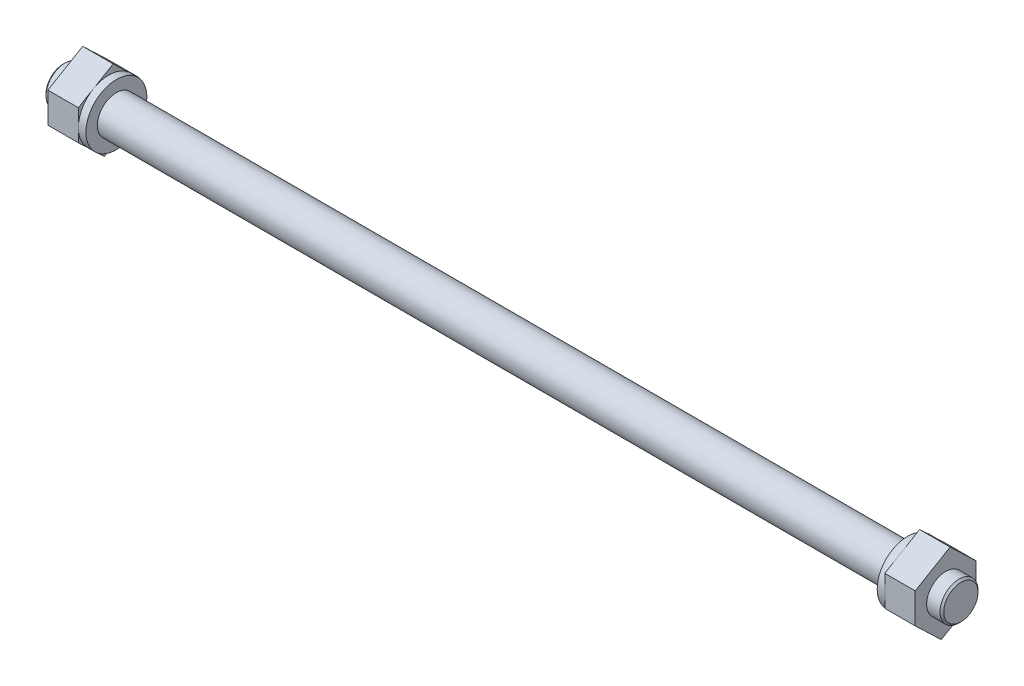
ISO-10303-21;
HEADER;
FILE_DESCRIPTION(('STEP AP214'),'2;1');
FILE_NAME('part.step','',(''),(''),'','','');
FILE_SCHEMA(('AUTOMOTIVE_DESIGN { 1 0 10303 214 1 1 1 1 }'));
ENDSEC;
DATA;
#1=APPLICATION_CONTEXT('core data for automotive mechanical design processes');
#2=APPLICATION_PROTOCOL_DEFINITION('international standard','automotive_design',2000,#1);
#3=PRODUCT_CONTEXT('',#1,'mechanical');
#4=PRODUCT('Part','Part','',(#3));
#5=PRODUCT_RELATED_PRODUCT_CATEGORY('part','',(#4));
#6=PRODUCT_DEFINITION_FORMATION('','',#4);
#7=PRODUCT_DEFINITION_CONTEXT('part definition',#1,'design');
#8=PRODUCT_DEFINITION('design','',#6,#7);
#9=PRODUCT_DEFINITION_SHAPE('','',#8);
#10=(LENGTH_UNIT() NAMED_UNIT(*) SI_UNIT(.MILLI.,.METRE.));
#11=(NAMED_UNIT(*) PLANE_ANGLE_UNIT() SI_UNIT($,.RADIAN.));
#12=(NAMED_UNIT(*) SI_UNIT($,.STERADIAN.) SOLID_ANGLE_UNIT());
#13=UNCERTAINTY_MEASURE_WITH_UNIT(LENGTH_MEASURE(1.E-05),#10,'distance_accuracy_value','');
#14=(GEOMETRIC_REPRESENTATION_CONTEXT(3) GLOBAL_UNCERTAINTY_ASSIGNED_CONTEXT((#13)) GLOBAL_UNIT_ASSIGNED_CONTEXT((#10,
#11,#12)) REPRESENTATION_CONTEXT('',''));
#15=CARTESIAN_POINT('',(0.,0.,0.));
#16=DIRECTION('',(0.,0.,1.));
#17=DIRECTION('',(1.,0.,0.));
#18=AXIS2_PLACEMENT_3D('',#15,#16,#17);
#19=CARTESIAN_POINT('',(-112.,-0.762935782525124,-6.58666148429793));
#20=DIRECTION('',(-1.,0.,0.));
#21=DIRECTION('',(0.,0.,1.));
#22=AXIS2_PLACEMENT_3D('',#19,#20,#21);
#23=PLANE('',#22);
#24=CARTESIAN_POINT('',(-112.,0.,0.));
#25=DIRECTION('',(-1.,0.,0.));
#26=DIRECTION('',(0.,0.,1.));
#27=AXIS2_PLACEMENT_3D('',#24,#25,#26);
#28=CIRCLE('',#27,4.00000000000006);
#29=CARTESIAN_POINT('',(-112.,-2.89136222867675,2.76405941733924));
#30=VERTEX_POINT('',#29);
#31=CARTESIAN_POINT('',(-112.,0.,4.00000000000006));
#32=VERTEX_POINT('',#31);
#33=EDGE_CURVE('E41',#30,#32,#28,.T.);
#34=ORIENTED_EDGE('',*,*,#33,.T.);
#35=DIRECTION('',(0.,-1.,0.));
#36=VECTOR('',#35,1.);
#37=CARTESIAN_POINT('',(-112.,2.28636451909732,4.));
#38=LINE('',#37,#36);
#39=CARTESIAN_POINT('',(-112.,-1.70983845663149,4.));
#40=VERTEX_POINT('',#39);
#41=EDGE_CURVE('E196',#32,#40,#38,.T.);
#42=ORIENTED_EDGE('',*,*,#41,.T.);
#43=DIRECTION('',(0.,-0.691014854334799,-0.722840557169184));
#44=VECTOR('',#43,1.);
#45=CARTESIAN_POINT('',(-112.,-1.70983845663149,4.));
#46=LINE('',#45,#44);
#47=EDGE_CURVE('E201',#40,#30,#46,.T.);
#48=ORIENTED_EDGE('',*,*,#47,.T.);
#49=EDGE_LOOP('',(#34,#42,#48));
#50=FACE_BOUND('',#49,.T.);
#51=ADVANCED_FACE('F26',(#50),#23,.F.);
#52=CARTESIAN_POINT('',(-112.,-3.44665142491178,-2.02992461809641));
#53=VERTEX_POINT('',#52);
#54=EDGE_CURVE('E45',#53,#30,#28,.T.);
#55=ORIENTED_EDGE('',*,*,#54,.T.);
#56=CARTESIAN_POINT('',(-112.,-4.98205774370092,0.577073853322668));
#57=VERTEX_POINT('',#56);
#58=EDGE_CURVE('E200',#30,#57,#46,.T.);
#59=ORIENTED_EDGE('',*,*,#58,.T.);
#60=DIRECTION('',(0.,0.507481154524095,-0.86166285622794));
#61=VECTOR('',#60,1.);
#62=CARTESIAN_POINT('',(-112.,-4.98205774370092,0.577073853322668));
#63=LINE('',#62,#61);
#64=EDGE_CURVE('E205',#57,#53,#63,.T.);
#65=ORIENTED_EDGE('',*,*,#64,.T.);
#66=EDGE_LOOP('',(#55,#59,#65));
#67=FACE_BOUND('',#66,.T.);
#68=ADVANCED_FACE('F331',(#67),#23,.F.);
#69=CARTESIAN_POINT('',(-112.,0.,-4.00000000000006));
#70=VERTEX_POINT('',#69);
#71=EDGE_CURVE('E598',#70,#53,#28,.T.);
#72=ORIENTED_EDGE('',*,*,#71,.T.);
#73=CARTESIAN_POINT('',(-112.,-2.28636451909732,-4.));
#74=VERTEX_POINT('',#73);
#75=EDGE_CURVE('E204',#53,#74,#63,.T.);
#76=ORIENTED_EDGE('',*,*,#75,.T.);
#77=DIRECTION('',(0.,1.,0.));
#78=VECTOR('',#77,1.);
#79=CARTESIAN_POINT('',(-112.,-2.28636451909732,-4.));
#80=LINE('',#79,#78);
#81=EDGE_CURVE('E209',#74,#70,#80,.T.);
#82=ORIENTED_EDGE('',*,*,#81,.T.);
#83=EDGE_LOOP('',(#72,#76,#82));
#84=FACE_BOUND('',#83,.T.);
#85=ADVANCED_FACE('F338',(#84),#23,.F.);
#86=CARTESIAN_POINT('',(-112.,2.89136222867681,-2.76405941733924));
#87=VERTEX_POINT('',#86);
#88=EDGE_CURVE('E602',#87,#70,#28,.T.);
#89=ORIENTED_EDGE('',*,*,#88,.T.);
#90=CARTESIAN_POINT('',(-112.,1.70983845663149,-4.));
#91=VERTEX_POINT('',#90);
#92=EDGE_CURVE('E208',#70,#91,#80,.T.);
#93=ORIENTED_EDGE('',*,*,#92,.T.);
#94=DIRECTION('',(0.,0.691014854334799,0.722840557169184));
#95=VECTOR('',#94,1.);
#96=CARTESIAN_POINT('',(-112.,1.70983845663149,-4.));
#97=LINE('',#96,#95);
#98=EDGE_CURVE('E191',#91,#87,#97,.T.);
#99=ORIENTED_EDGE('',*,*,#98,.T.);
#100=EDGE_LOOP('',(#89,#93,#99));
#101=FACE_BOUND('',#100,.T.);
#102=ADVANCED_FACE('F355',(#101),#23,.F.);
#103=CARTESIAN_POINT('',(-112.,3.44665142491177,2.02992461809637));
#104=VERTEX_POINT('',#103);
#105=EDGE_CURVE('E302',#104,#87,#28,.T.);
#106=ORIENTED_EDGE('',*,*,#105,.T.);
#107=CARTESIAN_POINT('',(-112.,4.98205774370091,-0.577073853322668));
#108=VERTEX_POINT('',#107);
#109=EDGE_CURVE('E190',#87,#108,#97,.T.);
#110=ORIENTED_EDGE('',*,*,#109,.T.);
#111=DIRECTION('',(0.,-0.507481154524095,0.86166285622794));
#112=VECTOR('',#111,1.);
#113=CARTESIAN_POINT('',(-112.,4.98205774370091,-0.577073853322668));
#114=LINE('',#113,#112);
#115=EDGE_CURVE('E159',#108,#104,#114,.T.);
#116=ORIENTED_EDGE('',*,*,#115,.T.);
#117=EDGE_LOOP('',(#106,#110,#116));
#118=FACE_BOUND('',#117,.T.);
#119=ADVANCED_FACE('F345',(#118),#23,.F.);
#120=CARTESIAN_POINT('',(-112.,1.70983845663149,-4.));
#121=DIRECTION('',(0.,-0.722840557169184,0.691014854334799));
#122=DIRECTION('',(0.,-0.691014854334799,-0.722840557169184));
#123=AXIS2_PLACEMENT_3D('',#120,#121,#122);
#124=PLANE('',#123);
#125=DIRECTION('',(-1.,0.,0.));
#126=VECTOR('',#125,1.);
#127=CARTESIAN_POINT('',(-112.,4.98205774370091,-0.577073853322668));
#128=LINE('',#127,#126);
#129=CARTESIAN_POINT('',(-116.,4.98205774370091,-0.577073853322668));
#130=VERTEX_POINT('',#129);
#131=EDGE_CURVE('E150',#108,#130,#128,.T.);
#132=ORIENTED_EDGE('',*,*,#131,.F.);
#133=ORIENTED_EDGE('',*,*,#109,.F.);
#134=ORIENTED_EDGE('',*,*,#98,.F.);
#135=DIRECTION('',(-1.,0.,0.));
#136=VECTOR('',#135,1.);
#137=CARTESIAN_POINT('',(-112.,1.70983845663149,-4.));
#138=LINE('',#137,#136);
#139=CARTESIAN_POINT('',(-116.,1.70983845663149,-4.));
#140=VERTEX_POINT('',#139);
#141=EDGE_CURVE('E170',#91,#140,#138,.T.);
#142=ORIENTED_EDGE('',*,*,#141,.T.);
#143=DIRECTION('',(0.,0.691014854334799,0.722840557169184));
#144=VECTOR('',#143,1.);
#145=CARTESIAN_POINT('',(-116.,1.70983845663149,-4.));
#146=LINE('',#145,#144);
#147=EDGE_CURVE('E166',#140,#130,#146,.T.);
#148=ORIENTED_EDGE('',*,*,#147,.T.);
#149=EDGE_LOOP('',(#132,#133,#134,#142,#148));
#150=FACE_BOUND('',#149,.T.);
#151=ADVANCED_FACE('F167',(#150),#124,.F.);
#152=CARTESIAN_POINT('',(-112.,4.98205774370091,-0.577073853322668));
#153=DIRECTION('',(0.,-0.86166285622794,-0.507481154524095));
#154=DIRECTION('',(0.,0.507481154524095,-0.86166285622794));
#155=AXIS2_PLACEMENT_3D('',#152,#153,#154);
#156=PLANE('',#155);
#157=DIRECTION('',(-1.,0.,0.));
#158=VECTOR('',#157,1.);
#159=CARTESIAN_POINT('',(-112.,2.28636451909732,4.));
#160=LINE('',#159,#158);
#161=CARTESIAN_POINT('',(-112.,2.28636451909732,4.));
#162=VERTEX_POINT('',#161);
#163=CARTESIAN_POINT('',(-116.,2.28636451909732,4.));
#164=VERTEX_POINT('',#163);
#165=EDGE_CURVE('E163',#162,#164,#160,.T.);
#166=ORIENTED_EDGE('',*,*,#165,.F.);
#167=EDGE_CURVE('E194',#104,#162,#114,.T.);
#168=ORIENTED_EDGE('',*,*,#167,.F.);
#169=ORIENTED_EDGE('',*,*,#115,.F.);
#170=ORIENTED_EDGE('',*,*,#131,.T.);
#171=DIRECTION('',(0.,-0.507481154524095,0.86166285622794));
#172=VECTOR('',#171,1.);
#173=CARTESIAN_POINT('',(-116.,4.98205774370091,-0.577073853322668));
#174=LINE('',#173,#172);
#175=EDGE_CURVE('E155',#130,#164,#174,.T.);
#176=ORIENTED_EDGE('',*,*,#175,.T.);
#177=EDGE_LOOP('',(#166,#168,#169,#170,#176));
#178=FACE_BOUND('',#177,.T.);
#179=ADVANCED_FACE('F153',(#178),#156,.F.);
#180=CARTESIAN_POINT('',(-112.,2.28636451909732,4.));
#181=DIRECTION('',(0.,0.,-1.));
#182=DIRECTION('',(0.,1.,0.));
#183=AXIS2_PLACEMENT_3D('',#180,#181,#182);
#184=PLANE('',#183);
#185=DIRECTION('',(-1.,0.,0.));
#186=VECTOR('',#185,1.);
#187=CARTESIAN_POINT('',(-112.,-1.70983845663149,4.));
#188=LINE('',#187,#186);
#189=CARTESIAN_POINT('',(-116.,-1.70983845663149,4.));
#190=VERTEX_POINT('',#189);
#191=EDGE_CURVE('E217',#40,#190,#188,.T.);
#192=ORIENTED_EDGE('',*,*,#191,.F.);
#193=ORIENTED_EDGE('',*,*,#41,.F.);
#194=EDGE_CURVE('E197',#162,#32,#38,.T.);
#195=ORIENTED_EDGE('',*,*,#194,.F.);
#196=ORIENTED_EDGE('',*,*,#165,.T.);
#197=DIRECTION('',(0.,-1.,0.));
#198=VECTOR('',#197,1.);
#199=CARTESIAN_POINT('',(-116.,2.28636451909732,4.));
#200=LINE('',#199,#198);
#201=EDGE_CURVE('E178',#164,#190,#200,.T.);
#202=ORIENTED_EDGE('',*,*,#201,.T.);
#203=EDGE_LOOP('',(#192,#193,#195,#196,#202));
#204=FACE_BOUND('',#203,.T.);
#205=ADVANCED_FACE('F364',(#204),#184,.F.);
#206=CARTESIAN_POINT('',(-112.,-1.70983845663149,4.));
#207=DIRECTION('',(0.,0.722840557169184,-0.691014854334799));
#208=DIRECTION('',(0.,0.691014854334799,0.722840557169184));
#209=AXIS2_PLACEMENT_3D('',#206,#207,#208);
#210=PLANE('',#209);
#211=DIRECTION('',(-1.,0.,0.));
#212=VECTOR('',#211,1.);
#213=CARTESIAN_POINT('',(-112.,-4.98205774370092,0.577073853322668));
#214=LINE('',#213,#212);
#215=CARTESIAN_POINT('',(-116.,-4.98205774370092,0.577073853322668));
#216=VERTEX_POINT('',#215);
#217=EDGE_CURVE('E215',#57,#216,#214,.T.);
#218=ORIENTED_EDGE('',*,*,#217,.F.);
#219=ORIENTED_EDGE('',*,*,#58,.F.);
#220=ORIENTED_EDGE('',*,*,#47,.F.);
#221=ORIENTED_EDGE('',*,*,#191,.T.);
#222=DIRECTION('',(0.,-0.691014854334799,-0.722840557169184));
#223=VECTOR('',#222,1.);
#224=CARTESIAN_POINT('',(-116.,-1.70983845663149,4.));
#225=LINE('',#224,#223);
#226=EDGE_CURVE('E180',#190,#216,#225,.T.);
#227=ORIENTED_EDGE('',*,*,#226,.T.);
#228=EDGE_LOOP('',(#218,#219,#220,#221,#227));
#229=FACE_BOUND('',#228,.T.);
#230=ADVANCED_FACE('F358',(#229),#210,.F.);
#231=CARTESIAN_POINT('',(-112.,-4.98205774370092,0.577073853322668));
#232=DIRECTION('',(0.,0.86166285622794,0.507481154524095));
#233=DIRECTION('',(0.,-0.507481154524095,0.86166285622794));
#234=AXIS2_PLACEMENT_3D('',#231,#232,#233);
#235=PLANE('',#234);
#236=DIRECTION('',(-1.,0.,0.));
#237=VECTOR('',#236,1.);
#238=CARTESIAN_POINT('',(-112.,-2.28636451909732,-4.));
#239=LINE('',#238,#237);
#240=CARTESIAN_POINT('',(-116.,-2.28636451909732,-4.));
#241=VERTEX_POINT('',#240);
#242=EDGE_CURVE('E213',#74,#241,#239,.T.);
#243=ORIENTED_EDGE('',*,*,#242,.F.);
#244=ORIENTED_EDGE('',*,*,#75,.F.);
#245=ORIENTED_EDGE('',*,*,#64,.F.);
#246=ORIENTED_EDGE('',*,*,#217,.T.);
#247=DIRECTION('',(0.,0.507481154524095,-0.86166285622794));
#248=VECTOR('',#247,1.);
#249=CARTESIAN_POINT('',(-116.,-4.98205774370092,0.577073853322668));
#250=LINE('',#249,#248);
#251=EDGE_CURVE('E185',#216,#241,#250,.T.);
#252=ORIENTED_EDGE('',*,*,#251,.T.);
#253=EDGE_LOOP('',(#243,#244,#245,#246,#252));
#254=FACE_BOUND('',#253,.T.);
#255=ADVANCED_FACE('F346',(#254),#235,.F.);
#256=CARTESIAN_POINT('',(-112.,-2.28636451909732,-4.));
#257=DIRECTION('',(0.,0.,1.));
#258=DIRECTION('',(0.,-1.,0.));
#259=AXIS2_PLACEMENT_3D('',#256,#257,#258);
#260=PLANE('',#259);
#261=ORIENTED_EDGE('',*,*,#81,.F.);
#262=ORIENTED_EDGE('',*,*,#242,.T.);
#263=DIRECTION('',(0.,1.,0.));
#264=VECTOR('',#263,1.);
#265=CARTESIAN_POINT('',(-116.,-2.28636451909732,-4.));
#266=LINE('',#265,#264);
#267=EDGE_CURVE('E188',#241,#140,#266,.T.);
#268=ORIENTED_EDGE('',*,*,#267,.T.);
#269=ORIENTED_EDGE('',*,*,#141,.F.);
#270=ORIENTED_EDGE('',*,*,#92,.F.);
#271=EDGE_LOOP('',(#261,#262,#268,#269,#270));
#272=FACE_BOUND('',#271,.T.);
#273=ADVANCED_FACE('F343',(#272),#260,.F.);
#274=EDGE_CURVE('E298',#32,#104,#28,.T.);
#275=ORIENTED_EDGE('',*,*,#274,.T.);
#276=ORIENTED_EDGE('',*,*,#167,.T.);
#277=ORIENTED_EDGE('',*,*,#194,.T.);
#278=EDGE_LOOP('',(#275,#276,#277));
#279=FACE_BOUND('',#278,.T.);
#280=ADVANCED_FACE('F334',(#279),#23,.F.);
#281=CARTESIAN_POINT('',(-116.,-0.762935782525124,-6.58666148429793));
#282=DIRECTION('',(-1.,0.,0.));
#283=DIRECTION('',(0.,0.,1.));
#284=AXIS2_PLACEMENT_3D('',#281,#282,#283);
#285=PLANE('',#284);
#286=CARTESIAN_POINT('',(-116.,0.,0.));
#287=DIRECTION('',(-1.,0.,0.));
#288=DIRECTION('',(0.,0.,1.));
#289=AXIS2_PLACEMENT_3D('',#286,#287,#288);
#290=CIRCLE('',#289,2.50000000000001);
#291=CARTESIAN_POINT('',(-116.,0.,2.50000000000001));
#292=VERTEX_POINT('',#291);
#293=EDGE_CURVE('E301',#292,#292,#290,.F.);
#294=ORIENTED_EDGE('',*,*,#293,.T.);
#295=EDGE_LOOP('',(#294));
#296=FACE_BOUND('',#295,.T.);
#297=ORIENTED_EDGE('',*,*,#147,.F.);
#298=ORIENTED_EDGE('',*,*,#267,.F.);
#299=ORIENTED_EDGE('',*,*,#251,.F.);
#300=ORIENTED_EDGE('',*,*,#226,.F.);
#301=ORIENTED_EDGE('',*,*,#201,.F.);
#302=ORIENTED_EDGE('',*,*,#175,.F.);
#303=EDGE_LOOP('',(#297,#298,#299,#300,#301,#302));
#304=FACE_BOUND('',#303,.T.);
#305=ADVANCED_FACE('F175',(#296,#304),#285,.T.);
#306=CARTESIAN_POINT('',(-128.,0.,0.));
#307=DIRECTION('',(-1.,0.,0.));
#308=DIRECTION('',(0.,0.,1.));
#309=AXIS2_PLACEMENT_3D('',#306,#307,#308);
#310=CYLINDRICAL_SURFACE('',#309,2.50000000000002);
#311=CARTESIAN_POINT('',(-0.25,0.,0.));
#312=DIRECTION('',(1.,0.,0.));
#313=DIRECTION('',(0.,0.,-1.));
#314=AXIS2_PLACEMENT_3D('',#311,#312,#313);
#315=CIRCLE('',#314,2.50000000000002);
#316=CARTESIAN_POINT('',(-0.25,0.,-2.50000000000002));
#317=VERTEX_POINT('',#316);
#318=EDGE_CURVE('E34',#317,#317,#315,.F.);
#319=ORIENTED_EDGE('',*,*,#318,.T.);
#320=EDGE_LOOP('',(#319));
#321=FACE_BOUND('',#320,.T.);
#322=CARTESIAN_POINT('',(-2.,0.,0.));
#323=DIRECTION('',(-1.,0.,0.));
#324=DIRECTION('',(0.,0.,1.));
#325=AXIS2_PLACEMENT_3D('',#322,#323,#324);
#326=CIRCLE('',#325,2.50000000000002);
#327=CARTESIAN_POINT('',(-2.,0.,2.50000000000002));
#328=VERTEX_POINT('',#327);
#329=EDGE_CURVE('E281',#328,#328,#326,.F.);
#330=ORIENTED_EDGE('',*,*,#329,.T.);
#331=EDGE_LOOP('',(#330));
#332=FACE_BOUND('',#331,.T.);
#333=ADVANCED_FACE('F315',(#321,#332),#310,.T.);
#334=CARTESIAN_POINT('',(0.,2.50000000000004,0.));
#335=DIRECTION('',(1.,0.,0.));
#336=DIRECTION('',(0.,0.,-1.));
#337=AXIS2_PLACEMENT_3D('',#334,#335,#336);
#338=PLANE('',#337);
#339=CARTESIAN_POINT('',(0.,0.,0.));
#340=DIRECTION('',(1.,0.,0.));
#341=DIRECTION('',(0.,0.,-1.));
#342=AXIS2_PLACEMENT_3D('',#339,#340,#341);
#343=CIRCLE('',#342,2.25000000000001);
#344=CARTESIAN_POINT('',(0.,0.,-2.25000000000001));
#345=VERTEX_POINT('',#344);
#346=EDGE_CURVE('E11',#345,#345,#343,.T.);
#347=ORIENTED_EDGE('',*,*,#346,.T.);
#348=EDGE_LOOP('',(#347));
#349=FACE_BOUND('',#348,.T.);
#350=ADVANCED_FACE('F378',(#349),#338,.T.);
#351=CARTESIAN_POINT('',(-6.,-0.762935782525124,-6.58666148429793));
#352=DIRECTION('',(-1.,0.,0.));
#353=DIRECTION('',(0.,0.,1.));
#354=AXIS2_PLACEMENT_3D('',#351,#352,#353);
#355=PLANE('',#354);
#356=DIRECTION('',(0.,-0.507481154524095,0.86166285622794));
#357=VECTOR('',#356,1.);
#358=CARTESIAN_POINT('',(-6.,4.98205774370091,-0.577073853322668));
#359=LINE('',#358,#357);
#360=CARTESIAN_POINT('',(-6.00000000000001,3.44665142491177,2.02992461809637));
#361=VERTEX_POINT('',#360);
#362=CARTESIAN_POINT('',(-6.,2.28636451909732,4.));
#363=VERTEX_POINT('',#362);
#364=EDGE_CURVE('E223',#361,#363,#359,.T.);
#365=ORIENTED_EDGE('',*,*,#364,.F.);
#366=CARTESIAN_POINT('',(-6.00000000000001,0.,0.));
#367=DIRECTION('',(-1.,0.,0.));
#368=DIRECTION('',(0.,0.,1.));
#369=AXIS2_PLACEMENT_3D('',#366,#367,#368);
#370=CIRCLE('',#369,4.00000000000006);
#371=CARTESIAN_POINT('',(-6.,0.,4.));
#372=VERTEX_POINT('',#371);
#373=EDGE_CURVE('E283',#372,#361,#370,.T.);
#374=ORIENTED_EDGE('',*,*,#373,.F.);
#375=DIRECTION('',(0.,-1.,0.));
#376=VECTOR('',#375,1.);
#377=CARTESIAN_POINT('',(-6.,2.28636451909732,4.));
#378=LINE('',#377,#376);
#379=EDGE_CURVE('E227',#363,#372,#378,.T.);
#380=ORIENTED_EDGE('',*,*,#379,.F.);
#381=EDGE_LOOP('',(#365,#374,#380));
#382=FACE_BOUND('',#381,.T.);
#383=ADVANCED_FACE('F374',(#382),#355,.T.);
#384=CARTESIAN_POINT('',(-2.,-0.762935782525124,-6.58666148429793));
#385=DIRECTION('',(-1.,0.,0.));
#386=DIRECTION('',(0.,0.,1.));
#387=AXIS2_PLACEMENT_3D('',#384,#385,#386);
#388=PLANE('',#387);
#389=ORIENTED_EDGE('',*,*,#329,.F.);
#390=EDGE_LOOP('',(#389));
#391=FACE_BOUND('',#390,.T.);
#392=DIRECTION('',(0.,0.691014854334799,0.722840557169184));
#393=VECTOR('',#392,1.);
#394=CARTESIAN_POINT('',(-2.,1.70983845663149,-4.));
#395=LINE('',#394,#393);
#396=CARTESIAN_POINT('',(-2.,1.70983845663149,-4.));
#397=VERTEX_POINT('',#396);
#398=CARTESIAN_POINT('',(-2.,4.98205774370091,-0.577073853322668));
#399=VERTEX_POINT('',#398);
#400=EDGE_CURVE('E242',#397,#399,#395,.T.);
#401=ORIENTED_EDGE('',*,*,#400,.T.);
#402=DIRECTION('',(0.,-0.507481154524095,0.86166285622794));
#403=VECTOR('',#402,1.);
#404=CARTESIAN_POINT('',(-2.,4.98205774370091,-0.577073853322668));
#405=LINE('',#404,#403);
#406=CARTESIAN_POINT('',(-2.,2.28636451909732,4.));
#407=VERTEX_POINT('',#406);
#408=EDGE_CURVE('E245',#399,#407,#405,.T.);
#409=ORIENTED_EDGE('',*,*,#408,.T.);
#410=DIRECTION('',(0.,-1.,0.));
#411=VECTOR('',#410,1.);
#412=CARTESIAN_POINT('',(-2.,2.28636451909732,4.));
#413=LINE('',#412,#411);
#414=CARTESIAN_POINT('',(-2.,-1.70983845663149,4.));
#415=VERTEX_POINT('',#414);
#416=EDGE_CURVE('E248',#407,#415,#413,.T.);
#417=ORIENTED_EDGE('',*,*,#416,.T.);
#418=DIRECTION('',(0.,-0.691014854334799,-0.722840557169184));
#419=VECTOR('',#418,1.);
#420=CARTESIAN_POINT('',(-2.,-1.70983845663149,4.));
#421=LINE('',#420,#419);
#422=CARTESIAN_POINT('',(-2.,-4.98205774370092,0.577073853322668));
#423=VERTEX_POINT('',#422);
#424=EDGE_CURVE('E251',#415,#423,#421,.T.);
#425=ORIENTED_EDGE('',*,*,#424,.T.);
#426=DIRECTION('',(0.,0.507481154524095,-0.86166285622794));
#427=VECTOR('',#426,1.);
#428=CARTESIAN_POINT('',(-2.,-4.98205774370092,0.577073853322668));
#429=LINE('',#428,#427);
#430=CARTESIAN_POINT('',(-2.,-2.28636451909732,-4.));
#431=VERTEX_POINT('',#430);
#432=EDGE_CURVE('E254',#423,#431,#429,.T.);
#433=ORIENTED_EDGE('',*,*,#432,.T.);
#434=DIRECTION('',(0.,1.,0.));
#435=VECTOR('',#434,1.);
#436=CARTESIAN_POINT('',(-2.,-2.28636451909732,-4.));
#437=LINE('',#436,#435);
#438=EDGE_CURVE('E257',#431,#397,#437,.T.);
#439=ORIENTED_EDGE('',*,*,#438,.T.);
#440=EDGE_LOOP('',(#401,#409,#417,#425,#433,#439));
#441=FACE_BOUND('',#440,.T.);
#442=ADVANCED_FACE('F377',(#391,#441),#388,.F.);
#443=CARTESIAN_POINT('',(-2.,-2.28636451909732,-4.));
#444=DIRECTION('',(0.,0.,1.));
#445=DIRECTION('',(0.,-1.,0.));
#446=AXIS2_PLACEMENT_3D('',#443,#444,#445);
#447=PLANE('',#446);
#448=ORIENTED_EDGE('',*,*,#438,.F.);
#449=DIRECTION('',(-1.,0.,0.));
#450=VECTOR('',#449,1.);
#451=CARTESIAN_POINT('',(-2.,-2.28636451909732,-4.));
#452=LINE('',#451,#450);
#453=CARTESIAN_POINT('',(-6.,-2.28636451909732,-4.));
#454=VERTEX_POINT('',#453);
#455=EDGE_CURVE('E263',#431,#454,#452,.T.);
#456=ORIENTED_EDGE('',*,*,#455,.T.);
#457=DIRECTION('',(0.,1.,0.));
#458=VECTOR('',#457,1.);
#459=CARTESIAN_POINT('',(-6.,-2.28636451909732,-4.));
#460=LINE('',#459,#458);
#461=CARTESIAN_POINT('',(-6.,0.,-4.));
#462=VERTEX_POINT('',#461);
#463=EDGE_CURVE('E239',#454,#462,#460,.T.);
#464=ORIENTED_EDGE('',*,*,#463,.T.);
#465=CARTESIAN_POINT('',(-6.,1.70983845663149,-4.));
#466=VERTEX_POINT('',#465);
#467=EDGE_CURVE('E238',#462,#466,#460,.T.);
#468=ORIENTED_EDGE('',*,*,#467,.T.);
#469=DIRECTION('',(-1.,0.,0.));
#470=VECTOR('',#469,1.);
#471=CARTESIAN_POINT('',(-2.,1.70983845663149,-4.));
#472=LINE('',#471,#470);
#473=EDGE_CURVE('E260',#397,#466,#472,.T.);
#474=ORIENTED_EDGE('',*,*,#473,.F.);
#475=EDGE_LOOP('',(#448,#456,#464,#468,#474));
#476=FACE_BOUND('',#475,.T.);
#477=ADVANCED_FACE('F384',(#476),#447,.F.);
#478=CARTESIAN_POINT('',(-2.,-4.98205774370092,0.577073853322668));
#479=DIRECTION('',(0.,0.86166285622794,0.507481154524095));
#480=DIRECTION('',(0.,-0.507481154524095,0.86166285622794));
#481=AXIS2_PLACEMENT_3D('',#478,#479,#480);
#482=PLANE('',#481);
#483=ORIENTED_EDGE('',*,*,#455,.F.);
#484=ORIENTED_EDGE('',*,*,#432,.F.);
#485=DIRECTION('',(-1.,0.,0.));
#486=VECTOR('',#485,1.);
#487=CARTESIAN_POINT('',(-2.,-4.98205774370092,0.577073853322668));
#488=LINE('',#487,#486);
#489=CARTESIAN_POINT('',(-6.,-4.98205774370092,0.577073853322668));
#490=VERTEX_POINT('',#489);
#491=EDGE_CURVE('E266',#423,#490,#488,.T.);
#492=ORIENTED_EDGE('',*,*,#491,.T.);
#493=DIRECTION('',(0.,0.507481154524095,-0.86166285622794));
#494=VECTOR('',#493,1.);
#495=CARTESIAN_POINT('',(-6.,-4.98205774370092,0.577073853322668));
#496=LINE('',#495,#494);
#497=CARTESIAN_POINT('',(-6.,-3.44665142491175,-2.02992461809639));
#498=VERTEX_POINT('',#497);
#499=EDGE_CURVE('E235',#490,#498,#496,.T.);
#500=ORIENTED_EDGE('',*,*,#499,.T.);
#501=EDGE_CURVE('E234',#498,#454,#496,.T.);
#502=ORIENTED_EDGE('',*,*,#501,.T.);
#503=EDGE_LOOP('',(#483,#484,#492,#500,#502));
#504=FACE_BOUND('',#503,.T.);
#505=ADVANCED_FACE('F393',(#504),#482,.F.);
#506=CARTESIAN_POINT('',(-2.,-1.70983845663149,4.));
#507=DIRECTION('',(0.,0.722840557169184,-0.691014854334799));
#508=DIRECTION('',(0.,0.691014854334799,0.722840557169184));
#509=AXIS2_PLACEMENT_3D('',#506,#507,#508);
#510=PLANE('',#509);
#511=ORIENTED_EDGE('',*,*,#491,.F.);
#512=ORIENTED_EDGE('',*,*,#424,.F.);
#513=DIRECTION('',(-1.,0.,0.));
#514=VECTOR('',#513,1.);
#515=CARTESIAN_POINT('',(-2.,-1.70983845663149,4.));
#516=LINE('',#515,#514);
#517=CARTESIAN_POINT('',(-6.,-1.70983845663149,4.));
#518=VERTEX_POINT('',#517);
#519=EDGE_CURVE('E269',#415,#518,#516,.T.);
#520=ORIENTED_EDGE('',*,*,#519,.T.);
#521=DIRECTION('',(0.,-0.691014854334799,-0.722840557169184));
#522=VECTOR('',#521,1.);
#523=CARTESIAN_POINT('',(-6.,-1.70983845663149,4.));
#524=LINE('',#523,#522);
#525=CARTESIAN_POINT('',(-6.,-2.89136222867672,2.76405941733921));
#526=VERTEX_POINT('',#525);
#527=EDGE_CURVE('E231',#518,#526,#524,.T.);
#528=ORIENTED_EDGE('',*,*,#527,.T.);
#529=EDGE_CURVE('E230',#526,#490,#524,.T.);
#530=ORIENTED_EDGE('',*,*,#529,.T.);
#531=EDGE_LOOP('',(#511,#512,#520,#528,#530));
#532=FACE_BOUND('',#531,.T.);
#533=ADVANCED_FACE('F397',(#532),#510,.F.);
#534=CARTESIAN_POINT('',(-2.,2.28636451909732,4.));
#535=DIRECTION('',(0.,0.,-1.));
#536=DIRECTION('',(0.,1.,0.));
#537=AXIS2_PLACEMENT_3D('',#534,#535,#536);
#538=PLANE('',#537);
#539=ORIENTED_EDGE('',*,*,#519,.F.);
#540=ORIENTED_EDGE('',*,*,#416,.F.);
#541=DIRECTION('',(-1.,0.,0.));
#542=VECTOR('',#541,1.);
#543=CARTESIAN_POINT('',(-2.,2.28636451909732,4.));
#544=LINE('',#543,#542);
#545=EDGE_CURVE('E272',#407,#363,#544,.T.);
#546=ORIENTED_EDGE('',*,*,#545,.T.);
#547=ORIENTED_EDGE('',*,*,#379,.T.);
#548=EDGE_CURVE('E226',#372,#518,#378,.T.);
#549=ORIENTED_EDGE('',*,*,#548,.T.);
#550=EDGE_LOOP('',(#539,#540,#546,#547,#549));
#551=FACE_BOUND('',#550,.T.);
#552=ADVANCED_FACE('F401',(#551),#538,.F.);
#553=CARTESIAN_POINT('',(-2.,4.98205774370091,-0.577073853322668));
#554=DIRECTION('',(0.,-0.86166285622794,-0.507481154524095));
#555=DIRECTION('',(0.,0.507481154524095,-0.86166285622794));
#556=AXIS2_PLACEMENT_3D('',#553,#554,#555);
#557=PLANE('',#556);
#558=ORIENTED_EDGE('',*,*,#545,.F.);
#559=ORIENTED_EDGE('',*,*,#408,.F.);
#560=DIRECTION('',(-1.,0.,0.));
#561=VECTOR('',#560,1.);
#562=CARTESIAN_POINT('',(-2.,4.98205774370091,-0.577073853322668));
#563=LINE('',#562,#561);
#564=CARTESIAN_POINT('',(-6.,4.98205774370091,-0.577073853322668));
#565=VERTEX_POINT('',#564);
#566=EDGE_CURVE('E275',#399,#565,#563,.T.);
#567=ORIENTED_EDGE('',*,*,#566,.T.);
#568=EDGE_CURVE('E224',#565,#361,#359,.T.);
#569=ORIENTED_EDGE('',*,*,#568,.T.);
#570=ORIENTED_EDGE('',*,*,#364,.T.);
#571=EDGE_LOOP('',(#558,#559,#567,#569,#570));
#572=FACE_BOUND('',#571,.T.);
#573=ADVANCED_FACE('F389',(#572),#557,.F.);
#574=CARTESIAN_POINT('',(-2.,1.70983845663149,-4.));
#575=DIRECTION('',(0.,-0.722840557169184,0.691014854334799));
#576=DIRECTION('',(0.,-0.691014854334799,-0.722840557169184));
#577=AXIS2_PLACEMENT_3D('',#574,#575,#576);
#578=PLANE('',#577);
#579=ORIENTED_EDGE('',*,*,#566,.F.);
#580=ORIENTED_EDGE('',*,*,#400,.F.);
#581=ORIENTED_EDGE('',*,*,#473,.T.);
#582=DIRECTION('',(0.,0.691014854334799,0.722840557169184));
#583=VECTOR('',#582,1.);
#584=CARTESIAN_POINT('',(-6.,1.70983845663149,-4.));
#585=LINE('',#584,#583);
#586=CARTESIAN_POINT('',(-6.,2.89136222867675,-2.76405941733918));
#587=VERTEX_POINT('',#586);
#588=EDGE_CURVE('E220',#466,#587,#585,.T.);
#589=ORIENTED_EDGE('',*,*,#588,.T.);
#590=EDGE_CURVE('E162',#587,#565,#585,.T.);
#591=ORIENTED_EDGE('',*,*,#590,.T.);
#592=EDGE_LOOP('',(#579,#580,#581,#589,#591));
#593=FACE_BOUND('',#592,.T.);
#594=ADVANCED_FACE('F386',(#593),#578,.F.);
#595=ORIENTED_EDGE('',*,*,#590,.F.);
#596=CARTESIAN_POINT('',(-6.00000000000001,0.,0.));
#597=DIRECTION('',(-1.,0.,0.));
#598=DIRECTION('',(0.,0.,1.));
#599=AXIS2_PLACEMENT_3D('',#596,#597,#598);
#600=CIRCLE('',#599,4.00000000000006);
#601=EDGE_CURVE('E278',#587,#361,#600,.F.);
#602=ORIENTED_EDGE('',*,*,#601,.T.);
#603=ORIENTED_EDGE('',*,*,#568,.F.);
#604=EDGE_LOOP('',(#595,#602,#603));
#605=FACE_BOUND('',#604,.T.);
#606=ADVANCED_FACE('F381',(#605),#355,.T.);
#607=ORIENTED_EDGE('',*,*,#467,.F.);
#608=EDGE_CURVE('E623',#462,#587,#600,.F.);
#609=ORIENTED_EDGE('',*,*,#608,.T.);
#610=ORIENTED_EDGE('',*,*,#588,.F.);
#611=EDGE_LOOP('',(#607,#609,#610));
#612=FACE_BOUND('',#611,.T.);
#613=ADVANCED_FACE('F488',(#612),#355,.T.);
#614=ORIENTED_EDGE('',*,*,#501,.F.);
#615=EDGE_CURVE('E625',#498,#462,#600,.F.);
#616=ORIENTED_EDGE('',*,*,#615,.T.);
#617=ORIENTED_EDGE('',*,*,#463,.F.);
#618=EDGE_LOOP('',(#614,#616,#617));
#619=FACE_BOUND('',#618,.T.);
#620=ADVANCED_FACE('F481',(#619),#355,.T.);
#621=ORIENTED_EDGE('',*,*,#529,.F.);
#622=EDGE_CURVE('E282',#526,#498,#600,.F.);
#623=ORIENTED_EDGE('',*,*,#622,.T.);
#624=ORIENTED_EDGE('',*,*,#499,.F.);
#625=EDGE_LOOP('',(#621,#623,#624));
#626=FACE_BOUND('',#625,.T.);
#627=ADVANCED_FACE('F473',(#626),#355,.T.);
#628=ORIENTED_EDGE('',*,*,#548,.F.);
#629=EDGE_CURVE('E279',#372,#526,#600,.F.);
#630=ORIENTED_EDGE('',*,*,#629,.T.);
#631=ORIENTED_EDGE('',*,*,#527,.F.);
#632=EDGE_LOOP('',(#628,#630,#631));
#633=FACE_BOUND('',#632,.T.);
#634=ADVANCED_FACE('F380',(#633),#355,.T.);
#635=CARTESIAN_POINT('',(-128.,0.,0.));
#636=DIRECTION('',(-1.,0.,0.));
#637=DIRECTION('',(0.,0.,1.));
#638=AXIS2_PLACEMENT_3D('',#635,#636,#637);
#639=CYLINDRICAL_SURFACE('',#638,4.00000000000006);
#640=ORIENTED_EDGE('',*,*,#373,.T.);
#641=ORIENTED_EDGE('',*,*,#601,.F.);
#642=ORIENTED_EDGE('',*,*,#608,.F.);
#643=ORIENTED_EDGE('',*,*,#615,.F.);
#644=ORIENTED_EDGE('',*,*,#622,.F.);
#645=ORIENTED_EDGE('',*,*,#629,.F.);
#646=EDGE_LOOP('',(#640,#641,#642,#643,#644,#645));
#647=FACE_BOUND('',#646,.T.);
#648=CARTESIAN_POINT('',(-7.00000000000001,0.,0.));
#649=DIRECTION('',(-1.,0.,0.));
#650=DIRECTION('',(0.,0.,1.));
#651=AXIS2_PLACEMENT_3D('',#648,#649,#650);
#652=CIRCLE('',#651,4.00000000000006);
#653=CARTESIAN_POINT('',(-7.00000000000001,0.,4.00000000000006));
#654=VERTEX_POINT('',#653);
#655=EDGE_CURVE('E286',#654,#654,#652,.T.);
#656=ORIENTED_EDGE('',*,*,#655,.F.);
#657=EDGE_LOOP('',(#656));
#658=FACE_BOUND('',#657,.T.);
#659=ADVANCED_FACE('F414',(#647,#658),#639,.T.);
#660=CARTESIAN_POINT('',(-7.,2.50000000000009,0.));
#661=DIRECTION('',(-1.,0.,0.));
#662=DIRECTION('',(0.,0.,1.));
#663=AXIS2_PLACEMENT_3D('',#660,#661,#662);
#664=PLANE('',#663);
#665=ORIENTED_EDGE('',*,*,#655,.T.);
#666=EDGE_LOOP('',(#665));
#667=FACE_BOUND('',#666,.T.);
#668=CARTESIAN_POINT('',(-7.00000000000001,0.,0.));
#669=DIRECTION('',(-1.,0.,0.));
#670=DIRECTION('',(0.,0.,1.));
#671=AXIS2_PLACEMENT_3D('',#668,#669,#670);
#672=CIRCLE('',#671,2.50000000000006);
#673=CARTESIAN_POINT('',(-7.00000000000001,0.,2.50000000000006));
#674=VERTEX_POINT('',#673);
#675=EDGE_CURVE('E289',#674,#674,#672,.T.);
#676=ORIENTED_EDGE('',*,*,#675,.F.);
#677=EDGE_LOOP('',(#676));
#678=FACE_BOUND('',#677,.T.);
#679=ADVANCED_FACE('F417',(#667,#678),#664,.T.);
#680=CARTESIAN_POINT('',(-128.,0.,0.));
#681=DIRECTION('',(-1.,0.,0.));
#682=DIRECTION('',(0.,0.,1.));
#683=AXIS2_PLACEMENT_3D('',#680,#681,#682);
#684=CYLINDRICAL_SURFACE('',#683,2.50000000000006);
#685=ORIENTED_EDGE('',*,*,#675,.T.);
#686=EDGE_LOOP('',(#685));
#687=FACE_BOUND('',#686,.T.);
#688=CARTESIAN_POINT('',(-111.,0.,0.));
#689=DIRECTION('',(-1.,0.,0.));
#690=DIRECTION('',(0.,0.,1.));
#691=AXIS2_PLACEMENT_3D('',#688,#689,#690);
#692=CIRCLE('',#691,2.50000000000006);
#693=CARTESIAN_POINT('',(-111.,0.,2.50000000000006));
#694=VERTEX_POINT('',#693);
#695=EDGE_CURVE('E292',#694,#694,#692,.T.);
#696=ORIENTED_EDGE('',*,*,#695,.F.);
#697=EDGE_LOOP('',(#696));
#698=FACE_BOUND('',#697,.T.);
#699=ADVANCED_FACE('F421',(#687,#698),#684,.T.);
#700=CARTESIAN_POINT('',(-111.,4.00000000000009,0.));
#701=DIRECTION('',(1.,0.,0.));
#702=DIRECTION('',(0.,0.,-1.));
#703=AXIS2_PLACEMENT_3D('',#700,#701,#702);
#704=PLANE('',#703);
#705=ORIENTED_EDGE('',*,*,#695,.T.);
#706=EDGE_LOOP('',(#705));
#707=FACE_BOUND('',#706,.T.);
#708=CARTESIAN_POINT('',(-111.,0.,0.));
#709=DIRECTION('',(-1.,0.,0.));
#710=DIRECTION('',(0.,0.,1.));
#711=AXIS2_PLACEMENT_3D('',#708,#709,#710);
#712=CIRCLE('',#711,4.00000000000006);
#713=CARTESIAN_POINT('',(-111.,0.,4.00000000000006));
#714=VERTEX_POINT('',#713);
#715=EDGE_CURVE('E295',#714,#714,#712,.T.);
#716=ORIENTED_EDGE('',*,*,#715,.F.);
#717=EDGE_LOOP('',(#716));
#718=FACE_BOUND('',#717,.T.);
#719=ADVANCED_FACE('F425',(#707,#718),#704,.T.);
#720=CARTESIAN_POINT('',(-128.,0.,0.));
#721=DIRECTION('',(-1.,0.,0.));
#722=DIRECTION('',(0.,0.,1.));
#723=AXIS2_PLACEMENT_3D('',#720,#721,#722);
#724=CYLINDRICAL_SURFACE('',#723,4.00000000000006);
#725=ORIENTED_EDGE('',*,*,#715,.T.);
#726=EDGE_LOOP('',(#725));
#727=FACE_BOUND('',#726,.T.);
#728=ORIENTED_EDGE('',*,*,#274,.F.);
#729=ORIENTED_EDGE('',*,*,#33,.F.);
#730=ORIENTED_EDGE('',*,*,#54,.F.);
#731=ORIENTED_EDGE('',*,*,#71,.F.);
#732=ORIENTED_EDGE('',*,*,#88,.F.);
#733=ORIENTED_EDGE('',*,*,#105,.F.);
#734=EDGE_LOOP('',(#728,#729,#730,#731,#732,#733));
#735=FACE_BOUND('',#734,.T.);
#736=ADVANCED_FACE('F429',(#727,#735),#724,.T.);
#737=CARTESIAN_POINT('',(-118.,0.,0.));
#738=DIRECTION('',(-1.,0.,0.));
#739=DIRECTION('',(0.,0.,1.));
#740=AXIS2_PLACEMENT_3D('',#737,#738,#739);
#741=PLANE('',#740);
#742=CARTESIAN_POINT('',(-118.,0.,0.));
#743=DIRECTION('',(-1.,0.,0.));
#744=DIRECTION('',(0.,0.,1.));
#745=AXIS2_PLACEMENT_3D('',#742,#743,#744);
#746=CIRCLE('',#745,2.25000000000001);
#747=CARTESIAN_POINT('',(-118.,0.,2.25000000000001));
#748=VERTEX_POINT('',#747);
#749=EDGE_CURVE('E307',#748,#748,#746,.T.);
#750=ORIENTED_EDGE('',*,*,#749,.T.);
#751=EDGE_LOOP('',(#750));
#752=FACE_BOUND('',#751,.T.);
#753=ADVANCED_FACE('F28',(#752),#741,.T.);
#754=CARTESIAN_POINT('',(-128.,0.,0.));
#755=DIRECTION('',(-1.,0.,0.));
#756=DIRECTION('',(0.,0.,1.));
#757=AXIS2_PLACEMENT_3D('',#754,#755,#756);
#758=CYLINDRICAL_SURFACE('',#757,2.50000000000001);
#759=CARTESIAN_POINT('',(-117.75,0.,0.));
#760=DIRECTION('',(-1.,0.,0.));
#761=DIRECTION('',(0.,0.,1.));
#762=AXIS2_PLACEMENT_3D('',#759,#760,#761);
#763=CIRCLE('',#762,2.50000000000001);
#764=CARTESIAN_POINT('',(-117.75,0.,2.50000000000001));
#765=VERTEX_POINT('',#764);
#766=EDGE_CURVE('E310',#765,#765,#763,.F.);
#767=ORIENTED_EDGE('',*,*,#766,.T.);
#768=EDGE_LOOP('',(#767));
#769=FACE_BOUND('',#768,.T.);
#770=ORIENTED_EDGE('',*,*,#293,.F.);
#771=EDGE_LOOP('',(#770));
#772=FACE_BOUND('',#771,.T.);
#773=ADVANCED_FACE('F326',(#769,#772),#758,.T.);
#774=CARTESIAN_POINT('',(-118.,0.,0.));
#775=DIRECTION('',(1.,0.,0.));
#776=DIRECTION('',(0.,0.,-1.));
#777=AXIS2_PLACEMENT_3D('',#774,#775,#776);
#778=CONICAL_SURFACE('',#777,2.25000000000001,0.785398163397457);
#779=ORIENTED_EDGE('',*,*,#766,.F.);
#780=EDGE_LOOP('',(#779));
#781=FACE_BOUND('',#780,.T.);
#782=ORIENTED_EDGE('',*,*,#749,.F.);
#783=EDGE_LOOP('',(#782));
#784=FACE_BOUND('',#783,.T.);
#785=ADVANCED_FACE('F320',(#781,#784),#778,.T.);
#786=CARTESIAN_POINT('',(-0.25,0.,0.));
#787=DIRECTION('',(-1.,0.,0.));
#788=DIRECTION('',(0.,0.,1.));
#789=AXIS2_PLACEMENT_3D('',#786,#787,#788);
#790=CONICAL_SURFACE('',#789,2.50000000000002,0.785398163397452);
#791=ORIENTED_EDGE('',*,*,#346,.F.);
#792=EDGE_LOOP('',(#791));
#793=FACE_BOUND('',#792,.T.);
#794=ORIENTED_EDGE('',*,*,#318,.F.);
#795=EDGE_LOOP('',(#794));
#796=FACE_BOUND('',#795,.T.);
#797=ADVANCED_FACE('F318',(#793,#796),#790,.T.);
#798=CLOSED_SHELL('',(#51,#68,#85,#102,#119,#151,#179,#205,#230,#255,#273,#280,#305,#333,#350,
#383,#442,#477,#505,#533,#552,#573,#594,#606,#613,#620,#627,#634,#659,#679,#699,#719,#736,#753,
#773,#785,#797));
#799=MANIFOLD_SOLID_BREP('B2',#798);
#800=ADVANCED_BREP_SHAPE_REPRESENTATION('',(#18,#799),#14);
#801=SHAPE_DEFINITION_REPRESENTATION(#9,#800);
ENDSEC;
END-ISO-10303-21;
